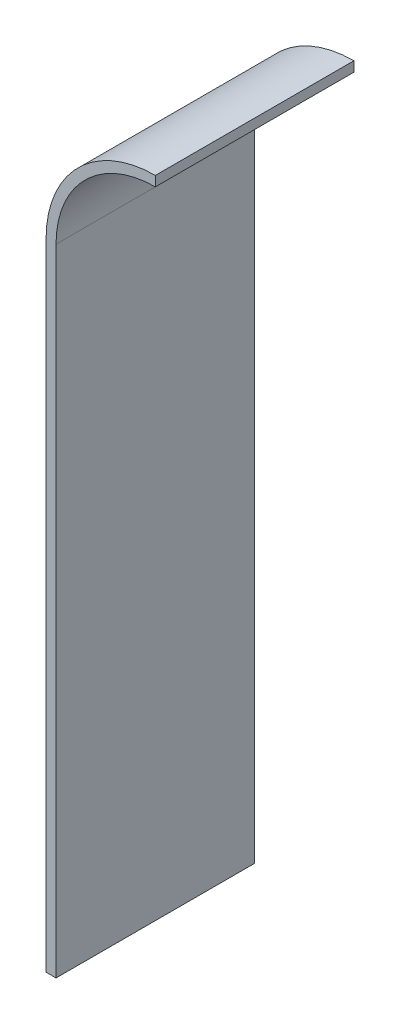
from build123d import *

# Parameters (mm, degrees)
EXTRUDE1_DEPTH = 20


with BuildPart() as part:
    # Sketch1 → Extrude1 (new body)
    with BuildSketch(Plane.XY):
        with BuildLine():
            Line((-10, 0), (-10, -64))
            Line((-10, -64), (-11, -64))
            Line((-11, -64), (-11, 0))
            ThreePointArc((-11, 0), (-7.778174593, 7.778174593), (0, 11))
            Line((0, 11), (0, 10))
            ThreePointArc((0, 10), (-7.071067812, 7.071067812), (-10, 0))
        make_face()
    extrude(amount=EXTRUDE1_DEPTH)


solid = part.part
